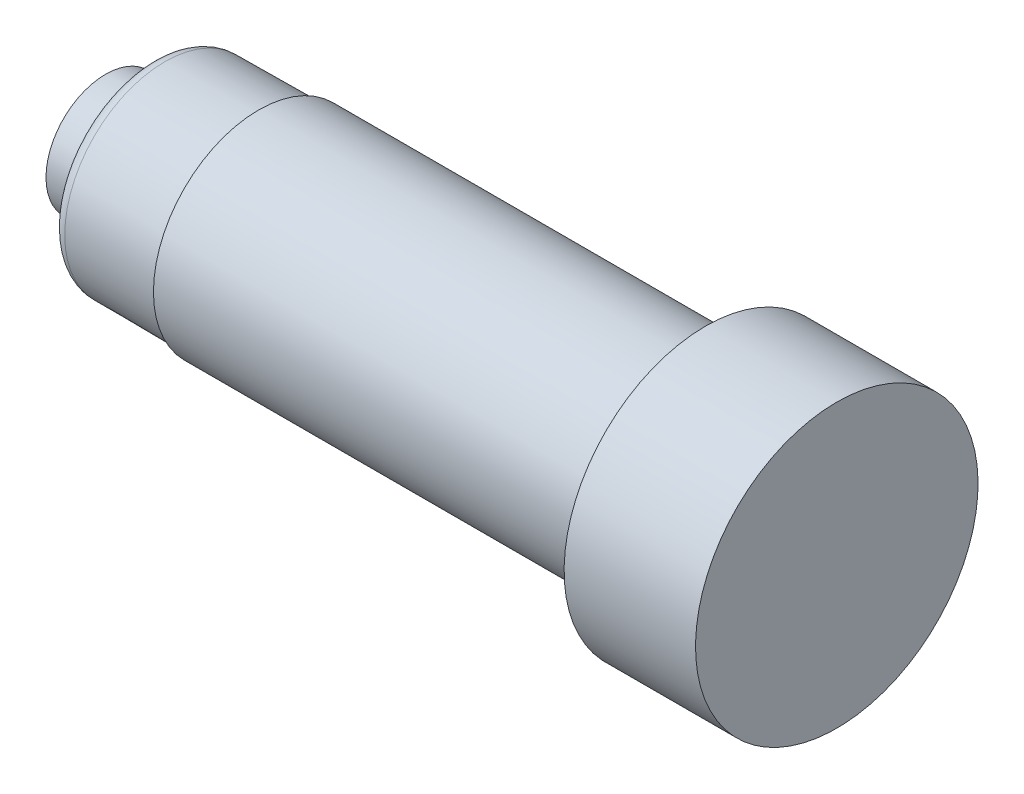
ISO-10303-21;
HEADER;
FILE_DESCRIPTION(('STEP AP214'),'2;1');
FILE_NAME('part.step','',(''),(''),'','','');
FILE_SCHEMA(('AUTOMOTIVE_DESIGN { 1 0 10303 214 1 1 1 1 }'));
ENDSEC;
DATA;
#1=APPLICATION_CONTEXT('core data for automotive mechanical design processes');
#2=APPLICATION_PROTOCOL_DEFINITION('international standard','automotive_design',2000,#1);
#3=PRODUCT_CONTEXT('',#1,'mechanical');
#4=PRODUCT('Part','Part','',(#3));
#5=PRODUCT_RELATED_PRODUCT_CATEGORY('part','',(#4));
#6=PRODUCT_DEFINITION_FORMATION('','',#4);
#7=PRODUCT_DEFINITION_CONTEXT('part definition',#1,'design');
#8=PRODUCT_DEFINITION('design','',#6,#7);
#9=PRODUCT_DEFINITION_SHAPE('','',#8);
#10=(LENGTH_UNIT() NAMED_UNIT(*) SI_UNIT(.MILLI.,.METRE.));
#11=(NAMED_UNIT(*) PLANE_ANGLE_UNIT() SI_UNIT($,.RADIAN.));
#12=(NAMED_UNIT(*) SI_UNIT($,.STERADIAN.) SOLID_ANGLE_UNIT());
#13=UNCERTAINTY_MEASURE_WITH_UNIT(LENGTH_MEASURE(1.E-05),#10,'distance_accuracy_value','');
#14=(GEOMETRIC_REPRESENTATION_CONTEXT(3) GLOBAL_UNCERTAINTY_ASSIGNED_CONTEXT((#13)) GLOBAL_UNIT_ASSIGNED_CONTEXT((#10,
#11,#12)) REPRESENTATION_CONTEXT('',''));
#15=CARTESIAN_POINT('',(0.,0.,0.));
#16=DIRECTION('',(0.,0.,1.));
#17=DIRECTION('',(1.,0.,0.));
#18=AXIS2_PLACEMENT_3D('',#15,#16,#17);
#19=CARTESIAN_POINT('',(60.9399999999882,0.,0.));
#20=DIRECTION('',(1.,0.,0.));
#21=DIRECTION('',(0.,1.,0.));
#22=AXIS2_PLACEMENT_3D('',#19,#20,#21);
#23=CONICAL_SURFACE('',#22,2.28357600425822,0.00872664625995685);
#24=CARTESIAN_POINT('',(60.4443632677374,0.,0.));
#25=DIRECTION('',(1.,0.,0.));
#26=DIRECTION('',(0.,1.,0.));
#27=AXIS2_PLACEMENT_3D('',#24,#25,#26);
#28=CIRCLE('',#27,2.27925064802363);
#29=CARTESIAN_POINT('',(60.4443632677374,2.27925064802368,0.));
#30=VERTEX_POINT('',#29);
#31=EDGE_CURVE('E46',#30,#30,#28,.F.);
#32=ORIENTED_EDGE('',*,*,#31,.T.);
#33=EDGE_LOOP('',(#32));
#34=FACE_BOUND('',#33,.T.);
#35=CARTESIAN_POINT('',(59.18,0.,0.));
#36=DIRECTION('',(-1.,0.,0.));
#37=DIRECTION('',(0.,-1.,0.));
#38=AXIS2_PLACEMENT_3D('',#35,#36,#37);
#39=CIRCLE('',#38,2.26821671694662);
#40=CARTESIAN_POINT('',(59.18,-2.26821671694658,0.));
#41=VERTEX_POINT('',#40);
#42=EDGE_CURVE('E33',#41,#41,#39,.F.);
#43=ORIENTED_EDGE('',*,*,#42,.T.);
#44=EDGE_LOOP('',(#43));
#45=FACE_BOUND('',#44,.T.);
#46=ADVANCED_FACE('F29',(#34,#45),#23,.T.);
#47=CARTESIAN_POINT('',(87.,5.37500000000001,0.));
#48=DIRECTION('',(1.,0.,0.));
#49=DIRECTION('',(0.,1.,0.));
#50=AXIS2_PLACEMENT_3D('',#47,#48,#49);
#51=PLANE('',#50);
#52=CARTESIAN_POINT('',(87.,2.44758141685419E-13,0.));
#53=DIRECTION('',(1.,0.,0.));
#54=DIRECTION('',(0.,1.,0.));
#55=AXIS2_PLACEMENT_3D('',#52,#53,#54);
#56=CIRCLE('',#55,5.37499999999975);
#57=CARTESIAN_POINT('',(87.,5.375,0.));
#58=VERTEX_POINT('',#57);
#59=EDGE_CURVE('E55',#58,#58,#56,.T.);
#60=ORIENTED_EDGE('',*,*,#59,.T.);
#61=EDGE_LOOP('',(#60));
#62=FACE_BOUND('',#61,.T.);
#63=ADVANCED_FACE('F83',(#62),#51,.T.);
#64=CARTESIAN_POINT('',(93.,2.90566182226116E-13,0.));
#65=DIRECTION('',(1.,0.,0.));
#66=DIRECTION('',(0.,1.,0.));
#67=AXIS2_PLACEMENT_3D('',#64,#65,#66);
#68=CYLINDRICAL_SURFACE('',#67,5.37499999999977);
#69=CARTESIAN_POINT('',(82.,2.06584774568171E-13,0.));
#70=DIRECTION('',(1.,0.,0.));
#71=DIRECTION('',(0.,1.,0.));
#72=AXIS2_PLACEMENT_3D('',#69,#70,#71);
#73=CIRCLE('',#72,5.37499999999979);
#74=CARTESIAN_POINT('',(82.,5.375,0.));
#75=VERTEX_POINT('',#74);
#76=EDGE_CURVE('E58',#75,#75,#73,.T.);
#77=ORIENTED_EDGE('',*,*,#76,.T.);
#78=EDGE_LOOP('',(#77));
#79=FACE_BOUND('',#78,.T.);
#80=ORIENTED_EDGE('',*,*,#59,.F.);
#81=EDGE_LOOP('',(#80));
#82=FACE_BOUND('',#81,.T.);
#83=ADVANCED_FACE('F88',(#79,#82),#68,.T.);
#84=CARTESIAN_POINT('',(82.,5.37500000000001,0.));
#85=DIRECTION('',(-1.,0.,0.));
#86=DIRECTION('',(0.,-1.,0.));
#87=AXIS2_PLACEMENT_3D('',#84,#85,#86);
#88=PLANE('',#87);
#89=CARTESIAN_POINT('',(82.,2.06584774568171E-13,0.));
#90=DIRECTION('',(-1.,0.,0.));
#91=DIRECTION('',(0.,-1.,0.));
#92=AXIS2_PLACEMENT_3D('',#89,#90,#91);
#93=CIRCLE('',#92,4.50000000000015);
#94=CARTESIAN_POINT('',(82.0000000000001,-4.49999999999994,0.));
#95=VERTEX_POINT('',#94);
#96=EDGE_CURVE('E37',#95,#95,#93,.F.);
#97=ORIENTED_EDGE('',*,*,#96,.T.);
#98=EDGE_LOOP('',(#97));
#99=FACE_BOUND('',#98,.T.);
#100=ORIENTED_EDGE('',*,*,#76,.F.);
#101=EDGE_LOOP('',(#100));
#102=FACE_BOUND('',#101,.T.);
#103=ADVANCED_FACE('F107',(#99,#102),#88,.T.);
#104=CARTESIAN_POINT('',(93.,2.90566182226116E-13,0.));
#105=DIRECTION('',(1.,0.,0.));
#106=DIRECTION('',(0.,1.,0.));
#107=AXIS2_PLACEMENT_3D('',#104,#105,#106);
#108=CYLINDRICAL_SURFACE('',#107,4.00000000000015);
#109=CARTESIAN_POINT('',(81.5,2.02767437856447E-13,0.));
#110=DIRECTION('',(-1.,0.,0.));
#111=DIRECTION('',(0.,-1.,0.));
#112=AXIS2_PLACEMENT_3D('',#109,#110,#111);
#113=CIRCLE('',#112,4.00000000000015);
#114=CARTESIAN_POINT('',(81.5000000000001,-3.99999999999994,0.));
#115=VERTEX_POINT('',#114);
#116=EDGE_CURVE('E10',#115,#115,#113,.T.);
#117=ORIENTED_EDGE('',*,*,#116,.T.);
#118=EDGE_LOOP('',(#117));
#119=FACE_BOUND('',#118,.T.);
#120=CARTESIAN_POINT('',(65.,0.,0.));
#121=DIRECTION('',(1.,0.,0.));
#122=DIRECTION('',(0.,1.,0.));
#123=AXIS2_PLACEMENT_3D('',#120,#121,#122);
#124=CIRCLE('',#123,4.00000000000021);
#125=CARTESIAN_POINT('',(65.,4.00000000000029,0.));
#126=VERTEX_POINT('',#125);
#127=EDGE_CURVE('E61',#126,#126,#124,.T.);
#128=ORIENTED_EDGE('',*,*,#127,.T.);
#129=EDGE_LOOP('',(#128));
#130=FACE_BOUND('',#129,.T.);
#131=ADVANCED_FACE('F104',(#119,#130),#108,.T.);
#132=CARTESIAN_POINT('',(64.999999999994,4.0000000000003,0.));
#133=DIRECTION('',(-1.,0.,0.));
#134=DIRECTION('',(0.,-1.,0.));
#135=AXIS2_PLACEMENT_3D('',#132,#133,#134);
#136=PLANE('',#135);
#137=CARTESIAN_POINT('',(64.9999999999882,0.,0.));
#138=DIRECTION('',(1.,0.,0.));
#139=DIRECTION('',(0.,1.,0.));
#140=AXIS2_PLACEMENT_3D('',#137,#138,#139);
#141=CIRCLE('',#140,3.8416810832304);
#142=CARTESIAN_POINT('',(64.9999999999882,3.84168108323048,0.));
#143=VERTEX_POINT('',#142);
#144=EDGE_CURVE('E64',#143,#143,#141,.T.);
#145=ORIENTED_EDGE('',*,*,#144,.T.);
#146=EDGE_LOOP('',(#145));
#147=FACE_BOUND('',#146,.T.);
#148=ORIENTED_EDGE('',*,*,#127,.F.);
#149=EDGE_LOOP('',(#148));
#150=FACE_BOUND('',#149,.T.);
#151=ADVANCED_FACE('F100',(#147,#150),#136,.T.);
#152=CARTESIAN_POINT('',(64.9999999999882,0.,0.));
#153=DIRECTION('',(1.,0.,0.));
#154=DIRECTION('',(0.,1.,0.));
#155=AXIS2_PLACEMENT_3D('',#152,#153,#154);
#156=CONICAL_SURFACE('',#155,3.8416810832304,0.00872664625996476);
#157=CARTESIAN_POINT('',(61.4356367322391,0.,0.));
#158=DIRECTION('',(-1.,0.,0.));
#159=DIRECTION('',(0.,-1.,0.));
#160=AXIS2_PLACEMENT_3D('',#157,#158,#159);
#161=CIRCLE('',#160,3.81057535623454);
#162=CARTESIAN_POINT('',(61.4356367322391,-3.81057535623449,0.));
#163=VERTEX_POINT('',#162);
#164=EDGE_CURVE('E41',#163,#163,#161,.F.);
#165=ORIENTED_EDGE('',*,*,#164,.T.);
#166=EDGE_LOOP('',(#165));
#167=FACE_BOUND('',#166,.T.);
#168=ORIENTED_EDGE('',*,*,#144,.F.);
#169=EDGE_LOOP('',(#168));
#170=FACE_BOUND('',#169,.T.);
#171=ADVANCED_FACE('F96',(#167,#170),#156,.T.);
#172=CARTESIAN_POINT('',(60.9399999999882,3.80625,0.));
#173=DIRECTION('',(-1.,0.,0.));
#174=DIRECTION('',(0.,-1.,0.));
#175=AXIS2_PLACEMENT_3D('',#172,#173,#174);
#176=PLANE('',#175);
#177=CARTESIAN_POINT('',(60.9399999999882,0.,0.));
#178=DIRECTION('',(-1.,0.,0.));
#179=DIRECTION('',(0.,-1.,0.));
#180=AXIS2_PLACEMENT_3D('',#177,#178,#179);
#181=CIRCLE('',#180,2.77923160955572);
#182=CARTESIAN_POINT('',(60.9399999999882,-2.77923160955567,0.));
#183=VERTEX_POINT('',#182);
#184=EDGE_CURVE('E49',#183,#183,#181,.F.);
#185=ORIENTED_EDGE('',*,*,#184,.T.);
#186=EDGE_LOOP('',(#185));
#187=FACE_BOUND('',#186,.T.);
#188=CARTESIAN_POINT('',(60.9399999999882,0.,0.));
#189=DIRECTION('',(-1.,0.,0.));
#190=DIRECTION('',(0.,-1.,0.));
#191=AXIS2_PLACEMENT_3D('',#188,#189,#190);
#192=CIRCLE('',#191,3.31059439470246);
#193=CARTESIAN_POINT('',(60.9399999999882,-3.31059439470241,0.));
#194=VERTEX_POINT('',#193);
#195=EDGE_CURVE('E52',#194,#194,#192,.T.);
#196=ORIENTED_EDGE('',*,*,#195,.T.);
#197=EDGE_LOOP('',(#196));
#198=FACE_BOUND('',#197,.T.);
#199=ADVANCED_FACE('F92',(#187,#198),#176,.T.);
#200=CARTESIAN_POINT('',(60.4399999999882,0.,0.));
#201=DIRECTION('',(-1.,0.,0.));
#202=DIRECTION('',(0.,-1.,0.));
#203=AXIS2_PLACEMENT_3D('',#200,#201,#202);
#204=TOROIDAL_SURFACE('',#203,2.77923160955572,0.5);
#205=ORIENTED_EDGE('',*,*,#31,.F.);
#206=EDGE_LOOP('',(#205));
#207=FACE_BOUND('',#206,.T.);
#208=ORIENTED_EDGE('',*,*,#184,.F.);
#209=EDGE_LOOP('',(#208));
#210=FACE_BOUND('',#209,.T.);
#211=ADVANCED_FACE('F95',(#207,#210),#204,.F.);
#212=CARTESIAN_POINT('',(61.4399999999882,0.,0.));
#213=DIRECTION('',(-1.,0.,0.));
#214=DIRECTION('',(0.,-1.,0.));
#215=AXIS2_PLACEMENT_3D('',#212,#213,#214);
#216=TOROIDAL_SURFACE('',#215,3.31059439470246,0.5);
#217=ORIENTED_EDGE('',*,*,#195,.F.);
#218=EDGE_LOOP('',(#217));
#219=FACE_BOUND('',#218,.T.);
#220=ORIENTED_EDGE('',*,*,#164,.F.);
#221=EDGE_LOOP('',(#220));
#222=FACE_BOUND('',#221,.T.);
#223=ADVANCED_FACE('F79',(#219,#222),#216,.T.);
#224=CARTESIAN_POINT('',(81.5,2.02767437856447E-13,0.));
#225=DIRECTION('',(-1.,0.,0.));
#226=DIRECTION('',(0.,-1.,0.));
#227=AXIS2_PLACEMENT_3D('',#224,#225,#226);
#228=TOROIDAL_SURFACE('',#227,4.50000000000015,0.5);
#229=ORIENTED_EDGE('',*,*,#116,.F.);
#230=EDGE_LOOP('',(#229));
#231=FACE_BOUND('',#230,.T.);
#232=ORIENTED_EDGE('',*,*,#96,.F.);
#233=EDGE_LOOP('',(#232));
#234=FACE_BOUND('',#233,.T.);
#235=ADVANCED_FACE('F31',(#231,#234),#228,.F.);
#236=CARTESIAN_POINT('',(59.18,0.,0.));
#237=DIRECTION('',(-1.,0.,0.));
#238=DIRECTION('',(0.,-1.,0.));
#239=AXIS2_PLACEMENT_3D('',#236,#237,#238);
#240=PLANE('',#239);
#241=ORIENTED_EDGE('',*,*,#42,.F.);
#242=EDGE_LOOP('',(#241));
#243=FACE_BOUND('',#242,.T.);
#244=ADVANCED_FACE('F72',(#243),#240,.T.);
#245=CLOSED_SHELL('',(#46,#63,#83,#103,#131,#151,#171,#199,#211,#223,#235,#244));
#246=MANIFOLD_SOLID_BREP('B2',#245);
#247=ADVANCED_BREP_SHAPE_REPRESENTATION('',(#18,#246),#14);
#248=SHAPE_DEFINITION_REPRESENTATION(#9,#247);
ENDSEC;
END-ISO-10303-21;
